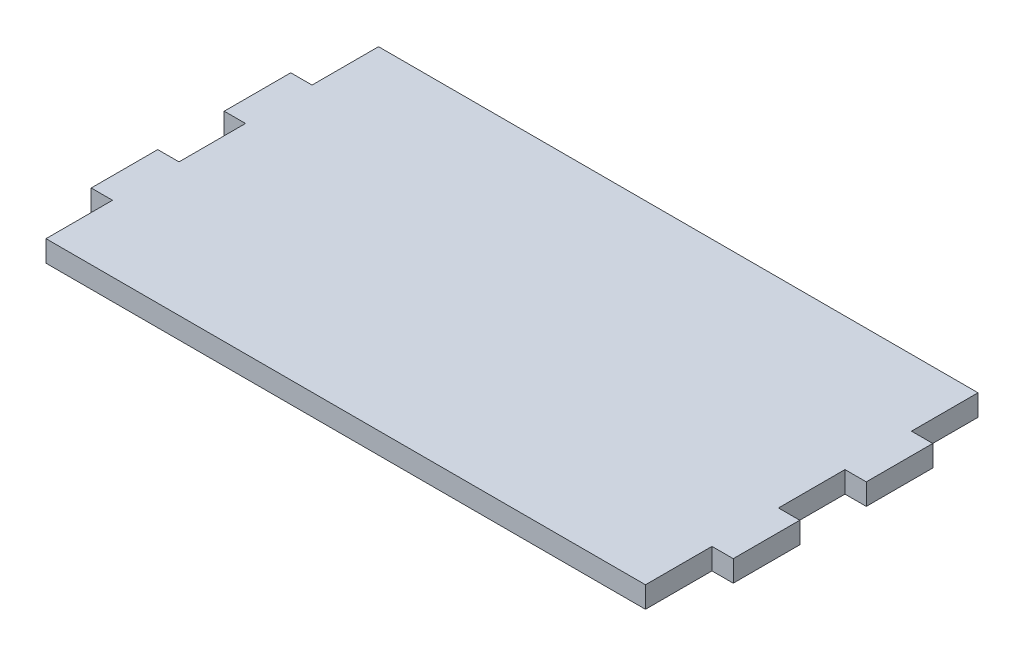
from build123d import *

# Parameters (mm, degrees)
SALIENTE_EXTRUIR1_DEPTH = 12


with BuildPart() as part:
    # Croquis1 → Saliente-Extruir1 (new body)
    with BuildSketch(Plane(origin=(0, 0, 0), x_dir=(1, 0, 0), z_dir=(0, 1, 0))):
        Polygon((-181, 18.75), (-181, 56.25), (-169, 56.25), (-169, 93.75), (169, 93.75), (169, 56.25), (181, 56.25), (181, 18.75), (169, 18.75), (169, -18.75), (181, -18.75), (181, -56.25), (169, -56.25), (169, -93.75), (-169, -93.75), (-169, -56.25), (-181, -56.25), (-181, -18.75), (-169, -18.75), (-169, 18.75), align=None)
    extrude(amount=SALIENTE_EXTRUIR1_DEPTH)


solid = part.part
